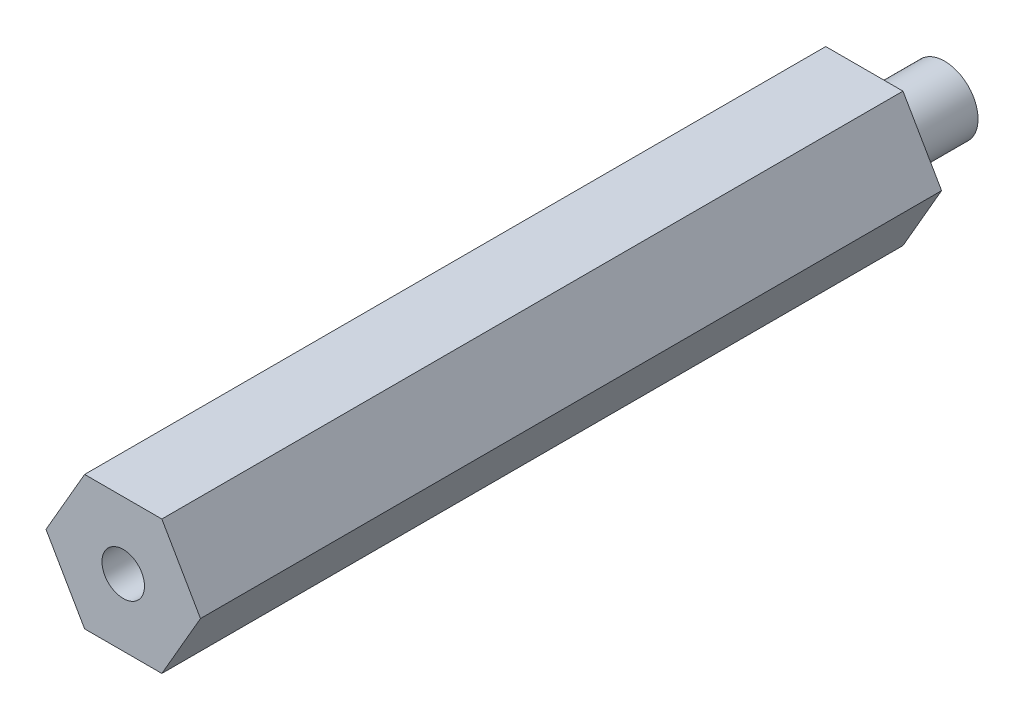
ISO-10303-21;
HEADER;
FILE_DESCRIPTION(('STEP AP214'),'2;1');
FILE_NAME('part.step','',(''),(''),'','','');
FILE_SCHEMA(('AUTOMOTIVE_DESIGN { 1 0 10303 214 1 1 1 1 }'));
ENDSEC;
DATA;
#1=APPLICATION_CONTEXT('core data for automotive mechanical design processes');
#2=APPLICATION_PROTOCOL_DEFINITION('international standard','automotive_design',2000,#1);
#3=PRODUCT_CONTEXT('',#1,'mechanical');
#4=PRODUCT('Part','Part','',(#3));
#5=PRODUCT_RELATED_PRODUCT_CATEGORY('part','',(#4));
#6=PRODUCT_DEFINITION_FORMATION('','',#4);
#7=PRODUCT_DEFINITION_CONTEXT('part definition',#1,'design');
#8=PRODUCT_DEFINITION('design','',#6,#7);
#9=PRODUCT_DEFINITION_SHAPE('','',#8);
#10=(LENGTH_UNIT() NAMED_UNIT(*) SI_UNIT(.MILLI.,.METRE.));
#11=(NAMED_UNIT(*) PLANE_ANGLE_UNIT() SI_UNIT($,.RADIAN.));
#12=(NAMED_UNIT(*) SI_UNIT($,.STERADIAN.) SOLID_ANGLE_UNIT());
#13=UNCERTAINTY_MEASURE_WITH_UNIT(LENGTH_MEASURE(1.E-05),#10,'distance_accuracy_value','');
#14=(GEOMETRIC_REPRESENTATION_CONTEXT(3) GLOBAL_UNCERTAINTY_ASSIGNED_CONTEXT((#13)) GLOBAL_UNIT_ASSIGNED_CONTEXT((#10,
#11,#12)) REPRESENTATION_CONTEXT('',''));
#15=CARTESIAN_POINT('',(0.,0.,0.));
#16=DIRECTION('',(0.,0.,1.));
#17=DIRECTION('',(1.,0.,0.));
#18=AXIS2_PLACEMENT_3D('',#15,#16,#17);
#19=CARTESIAN_POINT('',(3.66617420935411,-6.35000000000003,77.978));
#20=DIRECTION('',(-0.866025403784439,0.5,0.));
#21=DIRECTION('',(-0.5,-0.866025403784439,0.));
#22=AXIS2_PLACEMENT_3D('',#19,#20,#21);
#23=PLANE('',#22);
#24=DIRECTION('',(-0.5,-0.866025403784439,0.));
#25=VECTOR('',#24,1.);
#26=CARTESIAN_POINT('',(3.66617420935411,-6.35000000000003,7.62));
#27=LINE('',#26,#25);
#28=CARTESIAN_POINT('',(7.33234841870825,0.,7.62));
#29=VERTEX_POINT('',#28);
#30=CARTESIAN_POINT('',(3.66617420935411,-6.35000000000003,7.62));
#31=VERTEX_POINT('',#30);
#32=EDGE_CURVE('E48',#29,#31,#27,.T.);
#33=ORIENTED_EDGE('',*,*,#32,.F.);
#34=DIRECTION('',(0.,0.,-1.));
#35=VECTOR('',#34,1.);
#36=CARTESIAN_POINT('',(7.33234841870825,0.,77.978));
#37=LINE('',#36,#35);
#38=CARTESIAN_POINT('',(7.33234841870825,0.,77.978));
#39=VERTEX_POINT('',#38);
#40=EDGE_CURVE('E42',#39,#29,#37,.T.);
#41=ORIENTED_EDGE('',*,*,#40,.F.);
#42=DIRECTION('',(0.5,0.866025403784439,0.));
#43=VECTOR('',#42,1.);
#44=CARTESIAN_POINT('',(3.66617420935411,-6.35000000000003,77.978));
#45=LINE('',#44,#43);
#46=CARTESIAN_POINT('',(3.66617420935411,-6.35000000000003,77.978));
#47=VERTEX_POINT('',#46);
#48=EDGE_CURVE('E118',#47,#39,#45,.T.);
#49=ORIENTED_EDGE('',*,*,#48,.F.);
#50=DIRECTION('',(0.,0.,-1.));
#51=VECTOR('',#50,1.);
#52=CARTESIAN_POINT('',(3.66617420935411,-6.35000000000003,77.978));
#53=LINE('',#52,#51);
#54=EDGE_CURVE('E129',#47,#31,#53,.T.);
#55=ORIENTED_EDGE('',*,*,#54,.T.);
#56=EDGE_LOOP('',(#33,#41,#49,#55));
#57=FACE_BOUND('',#56,.T.);
#58=ADVANCED_FACE('F35',(#57),#23,.F.);
#59=CARTESIAN_POINT('',(7.33234841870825,0.,77.978));
#60=DIRECTION('',(-0.866025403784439,-0.5,0.));
#61=DIRECTION('',(0.499999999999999,-0.866025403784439,0.));
#62=AXIS2_PLACEMENT_3D('',#59,#60,#61);
#63=PLANE('',#62);
#64=DIRECTION('',(0.499999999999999,-0.866025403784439,0.));
#65=VECTOR('',#64,1.);
#66=CARTESIAN_POINT('',(7.33234841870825,0.,7.62));
#67=LINE('',#66,#65);
#68=CARTESIAN_POINT('',(3.66617420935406,6.35000000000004,7.62));
#69=VERTEX_POINT('',#68);
#70=EDGE_CURVE('E115',#69,#29,#67,.T.);
#71=ORIENTED_EDGE('',*,*,#70,.F.);
#72=DIRECTION('',(0.,0.,-1.));
#73=VECTOR('',#72,1.);
#74=CARTESIAN_POINT('',(3.66617420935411,6.35000000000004,77.978));
#75=LINE('',#74,#73);
#76=CARTESIAN_POINT('',(3.66617420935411,6.35000000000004,77.978));
#77=VERTEX_POINT('',#76);
#78=EDGE_CURVE('E141',#77,#69,#75,.T.);
#79=ORIENTED_EDGE('',*,*,#78,.F.);
#80=DIRECTION('',(-0.5,0.866025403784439,0.));
#81=VECTOR('',#80,1.);
#82=CARTESIAN_POINT('',(7.33234841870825,0.,77.978));
#83=LINE('',#82,#81);
#84=EDGE_CURVE('E120',#39,#77,#83,.T.);
#85=ORIENTED_EDGE('',*,*,#84,.F.);
#86=ORIENTED_EDGE('',*,*,#40,.T.);
#87=EDGE_LOOP('',(#71,#79,#85,#86));
#88=FACE_BOUND('',#87,.T.);
#89=ADVANCED_FACE('F147',(#88),#63,.F.);
#90=CARTESIAN_POINT('',(3.66617420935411,6.35000000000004,77.978));
#91=DIRECTION('',(0.,-1.,0.));
#92=DIRECTION('',(0.,0.,-1.));
#93=AXIS2_PLACEMENT_3D('',#90,#91,#92);
#94=PLANE('',#93);
#95=DIRECTION('',(1.,0.,0.));
#96=VECTOR('',#95,1.);
#97=CARTESIAN_POINT('',(3.66617420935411,6.35000000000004,7.62));
#98=LINE('',#97,#96);
#99=CARTESIAN_POINT('',(-3.66617420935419,6.34999999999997,7.62));
#100=VERTEX_POINT('',#99);
#101=EDGE_CURVE('E113',#100,#69,#98,.T.);
#102=ORIENTED_EDGE('',*,*,#101,.F.);
#103=DIRECTION('',(0.,0.,-1.));
#104=VECTOR('',#103,1.);
#105=CARTESIAN_POINT('',(-3.66617420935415,6.35000000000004,77.978));
#106=LINE('',#105,#104);
#107=CARTESIAN_POINT('',(-3.66617420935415,6.35000000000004,77.978));
#108=VERTEX_POINT('',#107);
#109=EDGE_CURVE('E138',#108,#100,#106,.T.);
#110=ORIENTED_EDGE('',*,*,#109,.F.);
#111=DIRECTION('',(-1.,0.,0.));
#112=VECTOR('',#111,1.);
#113=CARTESIAN_POINT('',(3.66617420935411,6.35000000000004,77.978));
#114=LINE('',#113,#112);
#115=EDGE_CURVE('E122',#77,#108,#114,.T.);
#116=ORIENTED_EDGE('',*,*,#115,.F.);
#117=ORIENTED_EDGE('',*,*,#78,.T.);
#118=EDGE_LOOP('',(#102,#110,#116,#117));
#119=FACE_BOUND('',#118,.T.);
#120=ADVANCED_FACE('F167',(#119),#94,.F.);
#121=CARTESIAN_POINT('',(-3.66617420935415,6.35000000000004,77.978));
#122=DIRECTION('',(0.866025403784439,-0.5,0.));
#123=DIRECTION('',(0.5,0.866025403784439,0.));
#124=AXIS2_PLACEMENT_3D('',#121,#122,#123);
#125=PLANE('',#124);
#126=DIRECTION('',(0.5,0.866025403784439,0.));
#127=VECTOR('',#126,1.);
#128=CARTESIAN_POINT('',(-3.66617420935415,6.35000000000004,7.62));
#129=LINE('',#128,#127);
#130=CARTESIAN_POINT('',(-7.33234841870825,0.,7.62));
#131=VERTEX_POINT('',#130);
#132=EDGE_CURVE('E111',#131,#100,#129,.T.);
#133=ORIENTED_EDGE('',*,*,#132,.F.);
#134=DIRECTION('',(0.,0.,-1.));
#135=VECTOR('',#134,1.);
#136=CARTESIAN_POINT('',(-7.33234841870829,0.,77.978));
#137=LINE('',#136,#135);
#138=CARTESIAN_POINT('',(-7.33234841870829,0.,77.978));
#139=VERTEX_POINT('',#138);
#140=EDGE_CURVE('E135',#139,#131,#137,.T.);
#141=ORIENTED_EDGE('',*,*,#140,.F.);
#142=DIRECTION('',(-0.5,-0.866025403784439,0.));
#143=VECTOR('',#142,1.);
#144=CARTESIAN_POINT('',(-3.66617420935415,6.35000000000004,77.978));
#145=LINE('',#144,#143);
#146=EDGE_CURVE('E124',#108,#139,#145,.T.);
#147=ORIENTED_EDGE('',*,*,#146,.F.);
#148=ORIENTED_EDGE('',*,*,#109,.T.);
#149=EDGE_LOOP('',(#133,#141,#147,#148));
#150=FACE_BOUND('',#149,.T.);
#151=ADVANCED_FACE('F163',(#150),#125,.F.);
#152=CARTESIAN_POINT('',(-7.33234841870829,0.,77.978));
#153=DIRECTION('',(0.866025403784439,0.5,0.));
#154=DIRECTION('',(-0.499999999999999,0.866025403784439,0.));
#155=AXIS2_PLACEMENT_3D('',#152,#153,#154);
#156=PLANE('',#155);
#157=DIRECTION('',(-0.499999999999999,0.866025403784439,0.));
#158=VECTOR('',#157,1.);
#159=CARTESIAN_POINT('',(-7.33234841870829,0.,7.62));
#160=LINE('',#159,#158);
#161=CARTESIAN_POINT('',(-3.66617420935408,-6.35000000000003,7.62));
#162=VERTEX_POINT('',#161);
#163=EDGE_CURVE('E109',#162,#131,#160,.T.);
#164=ORIENTED_EDGE('',*,*,#163,.F.);
#165=DIRECTION('',(0.,0.,-1.));
#166=VECTOR('',#165,1.);
#167=CARTESIAN_POINT('',(-3.66617420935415,-6.35000000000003,77.978));
#168=LINE('',#167,#166);
#169=CARTESIAN_POINT('',(-3.66617420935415,-6.35000000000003,77.978));
#170=VERTEX_POINT('',#169);
#171=EDGE_CURVE('E132',#170,#162,#168,.T.);
#172=ORIENTED_EDGE('',*,*,#171,.F.);
#173=DIRECTION('',(0.499999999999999,-0.866025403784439,0.));
#174=VECTOR('',#173,1.);
#175=CARTESIAN_POINT('',(-7.33234841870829,0.,77.978));
#176=LINE('',#175,#174);
#177=EDGE_CURVE('E126',#139,#170,#176,.T.);
#178=ORIENTED_EDGE('',*,*,#177,.F.);
#179=ORIENTED_EDGE('',*,*,#140,.T.);
#180=EDGE_LOOP('',(#164,#172,#178,#179));
#181=FACE_BOUND('',#180,.T.);
#182=ADVANCED_FACE('F158',(#181),#156,.F.);
#183=CARTESIAN_POINT('',(-3.66617420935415,-6.35000000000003,77.978));
#184=DIRECTION('',(0.,1.,0.));
#185=DIRECTION('',(0.,0.,1.));
#186=AXIS2_PLACEMENT_3D('',#183,#184,#185);
#187=PLANE('',#186);
#188=DIRECTION('',(-1.,0.,0.));
#189=VECTOR('',#188,1.);
#190=CARTESIAN_POINT('',(-3.66617420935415,-6.35000000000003,7.62));
#191=LINE('',#190,#189);
#192=EDGE_CURVE('E11',#31,#162,#191,.T.);
#193=ORIENTED_EDGE('',*,*,#192,.F.);
#194=ORIENTED_EDGE('',*,*,#54,.F.);
#195=DIRECTION('',(1.,0.,0.));
#196=VECTOR('',#195,1.);
#197=CARTESIAN_POINT('',(-3.66617420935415,-6.35000000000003,77.978));
#198=LINE('',#197,#196);
#199=EDGE_CURVE('E56',#170,#47,#198,.T.);
#200=ORIENTED_EDGE('',*,*,#199,.F.);
#201=ORIENTED_EDGE('',*,*,#171,.T.);
#202=EDGE_LOOP('',(#193,#194,#200,#201));
#203=FACE_BOUND('',#202,.T.);
#204=ADVANCED_FACE('F152',(#203),#187,.F.);
#205=CARTESIAN_POINT('',(0.,0.,77.978));
#206=DIRECTION('',(0.,0.,1.));
#207=DIRECTION('',(1.,0.,0.));
#208=AXIS2_PLACEMENT_3D('',#205,#206,#207);
#209=PLANE('',#208);
#210=CARTESIAN_POINT('',(0.,0.,77.978));
#211=DIRECTION('',(0.,0.,1.));
#212=DIRECTION('',(1.,0.,0.));
#213=AXIS2_PLACEMENT_3D('',#210,#211,#212);
#214=CIRCLE('',#213,2.01929999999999);
#215=CARTESIAN_POINT('',(2.01929999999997,0.,77.978));
#216=VERTEX_POINT('',#215);
#217=EDGE_CURVE('E99',#216,#216,#214,.T.);
#218=ORIENTED_EDGE('',*,*,#217,.F.);
#219=EDGE_LOOP('',(#218));
#220=FACE_BOUND('',#219,.T.);
#221=ORIENTED_EDGE('',*,*,#48,.T.);
#222=ORIENTED_EDGE('',*,*,#84,.T.);
#223=ORIENTED_EDGE('',*,*,#115,.T.);
#224=ORIENTED_EDGE('',*,*,#146,.T.);
#225=ORIENTED_EDGE('',*,*,#177,.T.);
#226=ORIENTED_EDGE('',*,*,#199,.T.);
#227=EDGE_LOOP('',(#221,#222,#223,#224,#225,#226));
#228=FACE_BOUND('',#227,.T.);
#229=ADVANCED_FACE('F169',(#220,#228),#209,.T.);
#230=CARTESIAN_POINT('',(3.175,0.,7.62));
#231=DIRECTION('',(0.,0.,-1.));
#232=DIRECTION('',(-1.,0.,0.));
#233=AXIS2_PLACEMENT_3D('',#230,#231,#232);
#234=PLANE('',#233);
#235=CARTESIAN_POINT('',(0.,0.,7.62));
#236=DIRECTION('',(0.,0.,-1.));
#237=DIRECTION('',(-1.,0.,0.));
#238=AXIS2_PLACEMENT_3D('',#235,#236,#237);
#239=CIRCLE('',#238,3.175);
#240=CARTESIAN_POINT('',(-3.175,0.,7.62));
#241=VERTEX_POINT('',#240);
#242=EDGE_CURVE('E102',#241,#241,#239,.T.);
#243=ORIENTED_EDGE('',*,*,#242,.F.);
#244=EDGE_LOOP('',(#243));
#245=FACE_BOUND('',#244,.T.);
#246=ORIENTED_EDGE('',*,*,#32,.T.);
#247=ORIENTED_EDGE('',*,*,#192,.T.);
#248=ORIENTED_EDGE('',*,*,#163,.T.);
#249=ORIENTED_EDGE('',*,*,#132,.T.);
#250=ORIENTED_EDGE('',*,*,#101,.T.);
#251=ORIENTED_EDGE('',*,*,#70,.T.);
#252=EDGE_LOOP('',(#246,#247,#248,#249,#250,#251));
#253=FACE_BOUND('',#252,.T.);
#254=ADVANCED_FACE('F155',(#245,#253),#234,.T.);
#255=CARTESIAN_POINT('',(0.,0.,0.));
#256=DIRECTION('',(0.,0.,-1.));
#257=DIRECTION('',(-1.,0.,0.));
#258=AXIS2_PLACEMENT_3D('',#255,#256,#257);
#259=CYLINDRICAL_SURFACE('',#258,3.175);
#260=ORIENTED_EDGE('',*,*,#242,.T.);
#261=EDGE_LOOP('',(#260));
#262=FACE_BOUND('',#261,.T.);
#263=CARTESIAN_POINT('',(0.,0.,0.));
#264=DIRECTION('',(0.,0.,-1.));
#265=DIRECTION('',(-1.,0.,0.));
#266=AXIS2_PLACEMENT_3D('',#263,#264,#265);
#267=CIRCLE('',#266,3.175);
#268=CARTESIAN_POINT('',(-3.175,0.,0.));
#269=VERTEX_POINT('',#268);
#270=EDGE_CURVE('E98',#269,#269,#267,.T.);
#271=ORIENTED_EDGE('',*,*,#270,.F.);
#272=EDGE_LOOP('',(#271));
#273=FACE_BOUND('',#272,.T.);
#274=ADVANCED_FACE('F177',(#262,#273),#259,.T.);
#275=CARTESIAN_POINT('',(0.,0.,0.));
#276=DIRECTION('',(0.,0.,1.));
#277=DIRECTION('',(1.,0.,0.));
#278=AXIS2_PLACEMENT_3D('',#275,#276,#277);
#279=PLANE('',#278);
#280=ORIENTED_EDGE('',*,*,#270,.T.);
#281=EDGE_LOOP('',(#280));
#282=FACE_BOUND('',#281,.T.);
#283=ADVANCED_FACE('F92',(#282),#279,.F.);
#284=CARTESIAN_POINT('',(0.,0.,65.278));
#285=DIRECTION('',(0.,0.,1.));
#286=DIRECTION('',(1.,0.,0.));
#287=AXIS2_PLACEMENT_3D('',#284,#285,#286);
#288=CONICAL_SURFACE('',#287,2.01929999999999,1.02974425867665);
#289=CARTESIAN_POINT('',(0.,0.,64.0646821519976));
#290=VERTEX_POINT('',#289);
#291=VERTEX_LOOP('',#290);
#292=FACE_BOUND('',#291,.T.);
#293=CARTESIAN_POINT('',(0.,0.,65.278));
#294=DIRECTION('',(0.,0.,1.));
#295=DIRECTION('',(1.,0.,0.));
#296=AXIS2_PLACEMENT_3D('',#293,#294,#295);
#297=CIRCLE('',#296,2.01929999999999);
#298=CARTESIAN_POINT('',(2.01929999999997,0.,65.278));
#299=VERTEX_POINT('',#298);
#300=EDGE_CURVE('E96',#299,#299,#297,.T.);
#301=ORIENTED_EDGE('',*,*,#300,.T.);
#302=EDGE_LOOP('',(#301));
#303=FACE_BOUND('',#302,.T.);
#304=ADVANCED_FACE('F88',(#292,#303),#288,.F.);
#305=CARTESIAN_POINT('',(0.,0.,77.978));
#306=DIRECTION('',(0.,0.,1.));
#307=DIRECTION('',(1.,0.,0.));
#308=AXIS2_PLACEMENT_3D('',#305,#306,#307);
#309=CYLINDRICAL_SURFACE('',#308,2.01929999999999);
#310=ORIENTED_EDGE('',*,*,#300,.F.);
#311=EDGE_LOOP('',(#310));
#312=FACE_BOUND('',#311,.T.);
#313=ORIENTED_EDGE('',*,*,#217,.T.);
#314=EDGE_LOOP('',(#313));
#315=FACE_BOUND('',#314,.T.);
#316=ADVANCED_FACE('F91',(#312,#315),#309,.F.);
#317=CLOSED_SHELL('',(#58,#89,#120,#151,#182,#204,#229,#254,#274,#283,#304,#316));
#318=MANIFOLD_SOLID_BREP('B2',#317);
#319=ADVANCED_BREP_SHAPE_REPRESENTATION('',(#18,#318),#14);
#320=SHAPE_DEFINITION_REPRESENTATION(#9,#319);
ENDSEC;
END-ISO-10303-21;
